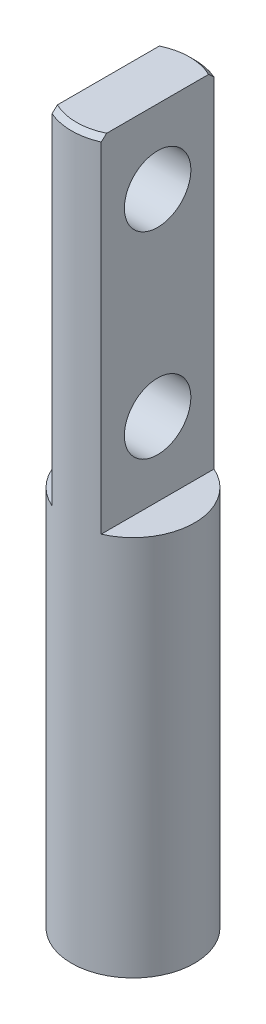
from build123d import *

# Parameters (mm, degrees)
SKETCH1_R           = 2.5
BOSS_EXTRUDE1_DEPTH = 15.5
BOSS_EXTRUDE2_DEPTH = 14
SKETCH4_R           = 1.35
CUT_EXTRUDE2_DEPTH  = 2
CHAMFER1_SIZE       = 0.2


with BuildPart() as part:
    # Sketch1 → Boss-Extrude1 (new body)
    with BuildSketch(Plane(origin=(0, 0, 0), x_dir=(1, 0, 0), z_dir=(0, 1, 0))):
        with Locations(Location((0, 0, 0), (0, 0, 270))):
            Circle(SKETCH1_R)
    extrude(amount=BOSS_EXTRUDE1_DEPTH)

    # Sketch3 → Boss-Extrude2 (add)
    with BuildSketch(Plane(origin=(0, 15.5, 0), x_dir=(1, 0, 0), z_dir=(0, 1, 0))):
        with BuildLine():
            Line((1, -2.291287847), (1, 2.291287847))
            ThreePointArc((1, 2.291287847), (0, 2.5), (-1, 2.291287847))
            Line((-1, 2.291287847), (-1, -2.291287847))
            ThreePointArc((-1, -2.291287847), (0, -2.5), (1, -2.291287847))
        make_face()
    extrude(amount=BOSS_EXTRUDE2_DEPTH)

    # Sketch4 → Cut-Extrude2 (cut)
    with BuildSketch(Plane.ZY.offset(1)):
        with Locations((0, 26.5)):
            Circle(SKETCH4_R)
        with Locations((0, 18.5)):
            Circle(SKETCH4_R)
    extrude(amount=-CUT_EXTRUDE2_DEPTH, mode=Mode.SUBTRACT)

    # Chamfer1
    chamfer1_edges = [part.edges().sort_by_distance(p)[0] for p in [
        (0, 29.5, -2.5),
        (0, 29.5, 2.5),
    ]]
    chamfer(chamfer1_edges, length=CHAMFER1_SIZE)


solid = part.part
